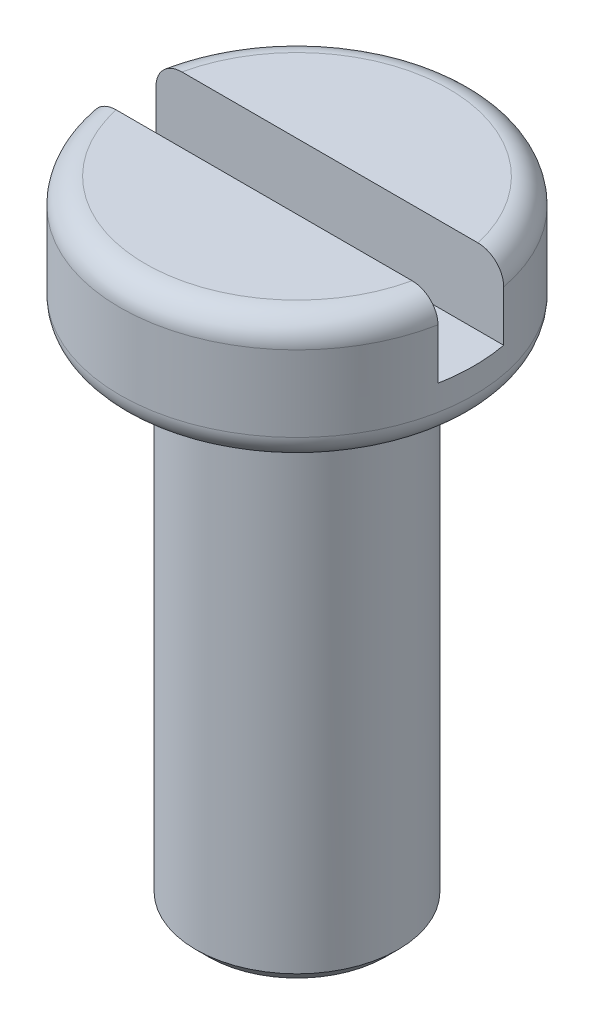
ISO-10303-21;
HEADER;
FILE_DESCRIPTION(('STEP AP214'),'2;1');
FILE_NAME('part.step','',(''),(''),'','','');
FILE_SCHEMA(('AUTOMOTIVE_DESIGN { 1 0 10303 214 1 1 1 1 }'));
ENDSEC;
DATA;
#1=APPLICATION_CONTEXT('core data for automotive mechanical design processes');
#2=APPLICATION_PROTOCOL_DEFINITION('international standard','automotive_design',2000,#1);
#3=PRODUCT_CONTEXT('',#1,'mechanical');
#4=PRODUCT('Part','Part','',(#3));
#5=PRODUCT_RELATED_PRODUCT_CATEGORY('part','',(#4));
#6=PRODUCT_DEFINITION_FORMATION('','',#4);
#7=PRODUCT_DEFINITION_CONTEXT('part definition',#1,'design');
#8=PRODUCT_DEFINITION('design','',#6,#7);
#9=PRODUCT_DEFINITION_SHAPE('','',#8);
#10=(LENGTH_UNIT() NAMED_UNIT(*) SI_UNIT(.MILLI.,.METRE.));
#11=(NAMED_UNIT(*) PLANE_ANGLE_UNIT() SI_UNIT($,.RADIAN.));
#12=(NAMED_UNIT(*) SI_UNIT($,.STERADIAN.) SOLID_ANGLE_UNIT());
#13=UNCERTAINTY_MEASURE_WITH_UNIT(LENGTH_MEASURE(1.E-05),#10,'distance_accuracy_value','');
#14=(GEOMETRIC_REPRESENTATION_CONTEXT(3) GLOBAL_UNCERTAINTY_ASSIGNED_CONTEXT((#13)) GLOBAL_UNIT_ASSIGNED_CONTEXT((#10,
#11,#12)) REPRESENTATION_CONTEXT('',''));
#15=CARTESIAN_POINT('',(0.,0.,0.));
#16=DIRECTION('',(0.,0.,1.));
#17=DIRECTION('',(1.,0.,0.));
#18=AXIS2_PLACEMENT_3D('',#15,#16,#17);
#19=CARTESIAN_POINT('',(0.,2.5,0.));
#20=DIRECTION('',(0.,1.,0.));
#21=DIRECTION('',(0.,0.,1.));
#22=AXIS2_PLACEMENT_3D('',#19,#20,#21);
#23=PLANE('',#22);
#24=DIRECTION('',(-1.,0.,0.));
#25=VECTOR('',#24,1.);
#26=CARTESIAN_POINT('',(-3.43911325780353,2.5,-0.65));
#27=LINE('',#26,#25);
#28=CARTESIAN_POINT('',(2.92873692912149,2.5,-0.65));
#29=VERTEX_POINT('',#28);
#30=CARTESIAN_POINT('',(-2.92873692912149,2.5,-0.65));
#31=VERTEX_POINT('',#30);
#32=EDGE_CURVE('E111',#29,#31,#27,.T.);
#33=ORIENTED_EDGE('',*,*,#32,.F.);
#34=CARTESIAN_POINT('',(0.,2.5,0.));
#35=DIRECTION('',(0.,1.,0.));
#36=DIRECTION('',(0.,0.,1.));
#37=AXIS2_PLACEMENT_3D('',#34,#35,#36);
#38=CIRCLE('',#37,3.);
#39=EDGE_CURVE('E183',#29,#31,#38,.T.);
#40=ORIENTED_EDGE('',*,*,#39,.T.);
#41=EDGE_LOOP('',(#33,#40));
#42=FACE_BOUND('',#41,.T.);
#43=ADVANCED_FACE('F34',(#42),#23,.T.);
#44=CARTESIAN_POINT('',(0.,2.5,0.));
#45=DIRECTION('',(0.,-1.,0.));
#46=DIRECTION('',(0.,0.,-1.));
#47=AXIS2_PLACEMENT_3D('',#44,#45,#46);
#48=CYLINDRICAL_SURFACE('',#47,3.5);
#49=CARTESIAN_POINT('',(0.,0.5,0.));
#50=DIRECTION('',(0.,1.,0.));
#51=DIRECTION('',(0.,0.,1.));
#52=AXIS2_PLACEMENT_3D('',#49,#50,#51);
#53=CIRCLE('',#52,3.5);
#54=CARTESIAN_POINT('',(0.,0.5,3.5));
#55=VERTEX_POINT('',#54);
#56=EDGE_CURVE('E126',#55,#55,#53,.T.);
#57=ORIENTED_EDGE('',*,*,#56,.T.);
#58=EDGE_LOOP('',(#57));
#59=FACE_BOUND('',#58,.T.);
#60=DIRECTION('',(0.,1.,0.));
#61=VECTOR('',#60,1.);
#62=CARTESIAN_POINT('',(3.43911325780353,1.,0.65));
#63=LINE('',#62,#61);
#64=CARTESIAN_POINT('',(3.43911325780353,1.,0.65));
#65=VERTEX_POINT('',#64);
#66=CARTESIAN_POINT('',(3.43911325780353,2.,0.65));
#67=VERTEX_POINT('',#66);
#68=EDGE_CURVE('E98',#65,#67,#63,.T.);
#69=ORIENTED_EDGE('',*,*,#68,.T.);
#70=CARTESIAN_POINT('',(0.,2.,0.));
#71=DIRECTION('',(0.,1.,0.));
#72=DIRECTION('',(0.,0.,1.));
#73=AXIS2_PLACEMENT_3D('',#70,#71,#72);
#74=CIRCLE('',#73,3.5);
#75=CARTESIAN_POINT('',(-3.43911325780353,2.,0.65));
#76=VERTEX_POINT('',#75);
#77=EDGE_CURVE('E115',#67,#76,#74,.F.);
#78=ORIENTED_EDGE('',*,*,#77,.T.);
#79=DIRECTION('',(0.,1.,0.));
#80=VECTOR('',#79,1.);
#81=CARTESIAN_POINT('',(-3.43911325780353,1.,0.65));
#82=LINE('',#81,#80);
#83=CARTESIAN_POINT('',(-3.43911325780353,1.,0.65));
#84=VERTEX_POINT('',#83);
#85=EDGE_CURVE('E95',#84,#76,#82,.T.);
#86=ORIENTED_EDGE('',*,*,#85,.F.);
#87=CARTESIAN_POINT('',(0.,1.,0.));
#88=DIRECTION('',(0.,1.,0.));
#89=DIRECTION('',(0.,0.,1.));
#90=AXIS2_PLACEMENT_3D('',#87,#88,#89);
#91=CIRCLE('',#90,3.5);
#92=CARTESIAN_POINT('',(-3.43911325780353,1.,-0.65));
#93=VERTEX_POINT('',#92);
#94=EDGE_CURVE('E102',#93,#84,#91,.T.);
#95=ORIENTED_EDGE('',*,*,#94,.F.);
#96=DIRECTION('',(0.,1.,0.));
#97=VECTOR('',#96,1.);
#98=CARTESIAN_POINT('',(-3.43911325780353,1.,-0.65));
#99=LINE('',#98,#97);
#100=CARTESIAN_POINT('',(-3.43911325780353,2.,-0.65));
#101=VERTEX_POINT('',#100);
#102=EDGE_CURVE('E124',#93,#101,#99,.T.);
#103=ORIENTED_EDGE('',*,*,#102,.T.);
#104=CARTESIAN_POINT('',(0.,2.,0.));
#105=DIRECTION('',(0.,1.,0.));
#106=DIRECTION('',(0.,0.,1.));
#107=AXIS2_PLACEMENT_3D('',#104,#105,#106);
#108=CIRCLE('',#107,3.5);
#109=CARTESIAN_POINT('',(3.43911325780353,2.,-0.65));
#110=VERTEX_POINT('',#109);
#111=EDGE_CURVE('E122',#101,#110,#108,.F.);
#112=ORIENTED_EDGE('',*,*,#111,.T.);
#113=DIRECTION('',(0.,1.,0.));
#114=VECTOR('',#113,1.);
#115=CARTESIAN_POINT('',(3.43911325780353,1.,-0.65));
#116=LINE('',#115,#114);
#117=CARTESIAN_POINT('',(3.43911325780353,1.,-0.65));
#118=VERTEX_POINT('',#117);
#119=EDGE_CURVE('E117',#118,#110,#116,.T.);
#120=ORIENTED_EDGE('',*,*,#119,.F.);
#121=CARTESIAN_POINT('',(0.,1.,0.));
#122=DIRECTION('',(0.,1.,0.));
#123=DIRECTION('',(0.,0.,-1.));
#124=AXIS2_PLACEMENT_3D('',#121,#122,#123);
#125=CIRCLE('',#124,3.50000000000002);
#126=EDGE_CURVE('E101',#65,#118,#125,.T.);
#127=ORIENTED_EDGE('',*,*,#126,.F.);
#128=EDGE_LOOP('',(#69,#78,#86,#95,#103,#112,#120,#127));
#129=FACE_BOUND('',#128,.T.);
#130=ADVANCED_FACE('F113',(#59,#129),#48,.T.);
#131=DIRECTION('',(1.,0.,0.));
#132=VECTOR('',#131,1.);
#133=CARTESIAN_POINT('',(-3.43911325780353,2.5,0.65));
#134=LINE('',#133,#132);
#135=CARTESIAN_POINT('',(-2.92873692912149,2.5,0.65));
#136=VERTEX_POINT('',#135);
#137=CARTESIAN_POINT('',(2.92873692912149,2.5,0.65));
#138=VERTEX_POINT('',#137);
#139=EDGE_CURVE('E184',#136,#138,#134,.T.);
#140=ORIENTED_EDGE('',*,*,#139,.F.);
#141=CARTESIAN_POINT('',(0.,2.5,0.));
#142=DIRECTION('',(0.,1.,0.));
#143=DIRECTION('',(0.,0.,1.));
#144=AXIS2_PLACEMENT_3D('',#141,#142,#143);
#145=CIRCLE('',#144,3.);
#146=EDGE_CURVE('E132',#136,#138,#145,.T.);
#147=ORIENTED_EDGE('',*,*,#146,.T.);
#148=EDGE_LOOP('',(#140,#147));
#149=FACE_BOUND('',#148,.T.);
#150=ADVANCED_FACE('F157',(#149),#23,.T.);
#151=CARTESIAN_POINT('',(0.,0.,0.));
#152=DIRECTION('',(0.,1.,0.));
#153=DIRECTION('',(0.,0.,1.));
#154=AXIS2_PLACEMENT_3D('',#151,#152,#153);
#155=PLANE('',#154);
#156=CARTESIAN_POINT('',(0.,0.,0.));
#157=DIRECTION('',(0.,1.,0.));
#158=DIRECTION('',(0.,0.,1.));
#159=AXIS2_PLACEMENT_3D('',#156,#157,#158);
#160=CIRCLE('',#159,2.);
#161=CARTESIAN_POINT('',(0.,0.,2.));
#162=VERTEX_POINT('',#161);
#163=EDGE_CURVE('E214',#162,#162,#160,.F.);
#164=ORIENTED_EDGE('',*,*,#163,.F.);
#165=EDGE_LOOP('',(#164));
#166=FACE_BOUND('',#165,.T.);
#167=CARTESIAN_POINT('',(0.,0.,0.));
#168=DIRECTION('',(0.,1.,0.));
#169=DIRECTION('',(0.,0.,1.));
#170=AXIS2_PLACEMENT_3D('',#167,#168,#169);
#171=CIRCLE('',#170,3.);
#172=CARTESIAN_POINT('',(0.,0.,3.));
#173=VERTEX_POINT('',#172);
#174=EDGE_CURVE('E129',#173,#173,#171,.F.);
#175=ORIENTED_EDGE('',*,*,#174,.T.);
#176=EDGE_LOOP('',(#175));
#177=FACE_BOUND('',#176,.T.);
#178=ADVANCED_FACE('F161',(#166,#177),#155,.F.);
#179=CARTESIAN_POINT('',(-3.43911325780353,1.,-0.65));
#180=DIRECTION('',(0.,0.,-1.));
#181=DIRECTION('',(-1.,0.,0.));
#182=AXIS2_PLACEMENT_3D('',#179,#180,#181);
#183=PLANE('',#182);
#184=ORIENTED_EDGE('',*,*,#32,.T.);
#185=CARTESIAN_POINT('',(-2.92873692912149,2.5,-0.65));
#186=CARTESIAN_POINT('',(-2.95792873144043,2.50002267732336,-0.65));
#187=CARTESIAN_POINT('',(-2.98712021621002,2.49756469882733,-0.65));
#188=CARTESIAN_POINT('',(-3.04468761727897,2.48782611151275,-0.65));
#189=CARTESIAN_POINT('',(-3.07306352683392,2.48054546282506,-0.65));
#190=CARTESIAN_POINT('',(-3.12820803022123,2.46129194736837,-0.65));
#191=CARTESIAN_POINT('',(-3.15497522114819,2.44931505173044,-0.65));
#192=CARTESIAN_POINT('',(-3.20607025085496,2.42098243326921,-0.65));
#193=CARTESIAN_POINT('',(-3.23039914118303,2.40462860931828,-0.65));
#194=CARTESIAN_POINT('',(-3.27557433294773,2.36822625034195,-0.65));
#195=CARTESIAN_POINT('',(-3.29646325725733,2.3482306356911,-0.65));
#196=CARTESIAN_POINT('',(-3.33451025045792,2.30494750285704,-0.65));
#197=CARTESIAN_POINT('',(-3.35166769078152,2.2816594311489,-0.65));
#198=CARTESIAN_POINT('',(-3.38140501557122,2.2329509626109,-0.65));
#199=CARTESIAN_POINT('',(-3.39406763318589,2.20758099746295,-0.65));
#200=CARTESIAN_POINT('',(-3.41487030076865,2.15506050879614,-0.65));
#201=CARTESIAN_POINT('',(-3.42301421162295,2.12791152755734,-0.65));
#202=CARTESIAN_POINT('',(-3.43221018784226,2.08379221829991,-0.65));
#203=CARTESIAN_POINT('',(-3.43479752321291,2.06712693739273,-0.65));
#204=CARTESIAN_POINT('',(-3.43824848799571,2.03364370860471,-0.65));
#205=CARTESIAN_POINT('',(-3.43911464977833,2.01682602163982,-0.65));
#206=CARTESIAN_POINT('',(-3.43911325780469,2.00000000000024,-0.65));
#207=B_SPLINE_CURVE_WITH_KNOTS('',3,(#185,#186,#187,#188,#189,#190,#191,#192,#193,#194,#195,
#196,#197,#198,#199,#200,#201,#202,#203,#204,#205,#206),.UNSPECIFIED.,.F.,.F.,(4,2,2,2,2,2,2,2,
2,2,4),(0.,0.0874723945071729,0.174945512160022,0.262493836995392,0.350004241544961,
0.436331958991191,0.522674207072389,0.607332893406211,0.691919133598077,0.742432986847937,
0.792872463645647),.UNSPECIFIED.);
#208=EDGE_CURVE('E49',#31,#101,#207,.T.);
#209=ORIENTED_EDGE('',*,*,#208,.T.);
#210=ORIENTED_EDGE('',*,*,#102,.F.);
#211=DIRECTION('',(-1.,0.,0.));
#212=VECTOR('',#211,1.);
#213=CARTESIAN_POINT('',(-3.43911325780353,1.,-0.65));
#214=LINE('',#213,#212);
#215=EDGE_CURVE('E108',#118,#93,#214,.T.);
#216=ORIENTED_EDGE('',*,*,#215,.F.);
#217=ORIENTED_EDGE('',*,*,#119,.T.);
#218=CARTESIAN_POINT('',(3.43911325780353,2.,-0.65));
#219=CARTESIAN_POINT('',(3.43913889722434,2.02775947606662,-0.65));
#220=CARTESIAN_POINT('',(3.43676218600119,2.05550931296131,-0.65));
#221=CARTESIAN_POINT('',(3.42739618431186,2.11018556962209,-0.65));
#222=CARTESIAN_POINT('',(3.42041258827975,2.1371129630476,-0.65));
#223=CARTESIAN_POINT('',(3.40202102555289,2.18942116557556,-0.65));
#224=CARTESIAN_POINT('',(3.39061159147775,2.21480145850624,-0.65));
#225=CARTESIAN_POINT('',(3.36372457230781,2.26330231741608,-0.65));
#226=CARTESIAN_POINT('',(3.34824720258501,2.28642300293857,-0.65));
#227=CARTESIAN_POINT('',(3.3135629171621,2.32993329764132,-0.65));
#228=CARTESIAN_POINT('',(3.29433111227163,2.350303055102,-0.65));
#229=CARTESIAN_POINT('',(3.25276768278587,2.38759157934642,-0.65));
#230=CARTESIAN_POINT('',(3.23043544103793,2.40450965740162,-0.65));
#231=CARTESIAN_POINT('',(3.18291250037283,2.43471951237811,-0.65));
#232=CARTESIAN_POINT('',(3.15768005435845,2.44794553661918,-0.65));
#233=CARTESIAN_POINT('',(3.10538462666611,2.47006329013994,-0.65));
#234=CARTESIAN_POINT('',(3.07832208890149,2.47895606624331,-0.65));
#235=CARTESIAN_POINT('',(3.03075677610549,2.4903779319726,-0.65));
#236=CARTESIAN_POINT('',(3.01050564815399,2.49398609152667,-0.65));
#237=CARTESIAN_POINT('',(2.96975060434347,2.49879703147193,-0.65));
#238=CARTESIAN_POINT('',(2.94924711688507,2.50000343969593,-0.65));
#239=CARTESIAN_POINT('',(2.92873692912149,2.5,-0.65));
#240=B_SPLINE_CURVE_WITH_KNOTS('',3,(#218,#219,#220,#221,#222,#223,#224,#225,#226,#227,#228,
#229,#230,#231,#232,#233,#234,#235,#236,#237,#238,#239),.UNSPECIFIED.,.F.,.F.,(4,2,2,2,2,2,2,2,
2,2,4),(0.,0.0831625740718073,0.166222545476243,0.249310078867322,0.332393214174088,
0.416047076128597,0.499717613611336,0.584794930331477,0.669851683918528,0.731426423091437,
0.792908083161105),.UNSPECIFIED.);
#241=EDGE_CURVE('E57',#110,#29,#240,.T.);
#242=ORIENTED_EDGE('',*,*,#241,.T.);
#243=EDGE_LOOP('',(#184,#209,#210,#216,#217,#242));
#244=FACE_BOUND('',#243,.T.);
#245=ADVANCED_FACE('F154',(#244),#183,.F.);
#246=CARTESIAN_POINT('',(-3.43911325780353,1.,0.65));
#247=DIRECTION('',(0.,0.,1.));
#248=DIRECTION('',(1.,0.,0.));
#249=AXIS2_PLACEMENT_3D('',#246,#247,#248);
#250=PLANE('',#249);
#251=ORIENTED_EDGE('',*,*,#139,.T.);
#252=CARTESIAN_POINT('',(2.92873692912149,2.5,0.65));
#253=CARTESIAN_POINT('',(2.95792873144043,2.50002267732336,0.65));
#254=CARTESIAN_POINT('',(2.98712021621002,2.49756469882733,0.65));
#255=CARTESIAN_POINT('',(3.04468761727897,2.48782611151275,0.65));
#256=CARTESIAN_POINT('',(3.07306352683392,2.48054546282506,0.65));
#257=CARTESIAN_POINT('',(3.12820803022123,2.46129194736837,0.65));
#258=CARTESIAN_POINT('',(3.15497522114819,2.44931505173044,0.65));
#259=CARTESIAN_POINT('',(3.20607025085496,2.42098243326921,0.65));
#260=CARTESIAN_POINT('',(3.23039914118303,2.40462860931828,0.65));
#261=CARTESIAN_POINT('',(3.27557433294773,2.36822625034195,0.65));
#262=CARTESIAN_POINT('',(3.29646325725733,2.3482306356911,0.65));
#263=CARTESIAN_POINT('',(3.33451025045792,2.30494750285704,0.65));
#264=CARTESIAN_POINT('',(3.35166769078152,2.2816594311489,0.65));
#265=CARTESIAN_POINT('',(3.38140501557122,2.2329509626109,0.65));
#266=CARTESIAN_POINT('',(3.39406763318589,2.20758099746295,0.65));
#267=CARTESIAN_POINT('',(3.41487030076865,2.15506050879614,0.65));
#268=CARTESIAN_POINT('',(3.42301421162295,2.12791152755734,0.65));
#269=CARTESIAN_POINT('',(3.43221018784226,2.08379221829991,0.65));
#270=CARTESIAN_POINT('',(3.43479752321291,2.06712693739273,0.65));
#271=CARTESIAN_POINT('',(3.43824848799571,2.03364370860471,0.65));
#272=CARTESIAN_POINT('',(3.43911464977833,2.01682602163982,0.65));
#273=CARTESIAN_POINT('',(3.43911325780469,2.00000000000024,0.65));
#274=B_SPLINE_CURVE_WITH_KNOTS('',3,(#252,#253,#254,#255,#256,#257,#258,#259,#260,#261,#262,
#263,#264,#265,#266,#267,#268,#269,#270,#271,#272,#273),.UNSPECIFIED.,.F.,.F.,(4,2,2,2,2,2,2,2,
2,2,4),(0.,0.0874723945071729,0.174945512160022,0.262493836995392,0.350004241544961,
0.436331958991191,0.522674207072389,0.607332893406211,0.691919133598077,0.742432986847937,
0.792872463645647),.UNSPECIFIED.);
#275=EDGE_CURVE('E142',#138,#67,#274,.T.);
#276=ORIENTED_EDGE('',*,*,#275,.T.);
#277=ORIENTED_EDGE('',*,*,#68,.F.);
#278=DIRECTION('',(1.,0.,0.));
#279=VECTOR('',#278,1.);
#280=CARTESIAN_POINT('',(-3.43911325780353,1.,0.65));
#281=LINE('',#280,#279);
#282=EDGE_CURVE('E90',#84,#65,#281,.T.);
#283=ORIENTED_EDGE('',*,*,#282,.F.);
#284=ORIENTED_EDGE('',*,*,#85,.T.);
#285=CARTESIAN_POINT('',(-3.43911325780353,2.,0.65));
#286=CARTESIAN_POINT('',(-3.43913889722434,2.02775947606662,0.65));
#287=CARTESIAN_POINT('',(-3.43676218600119,2.05550931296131,0.65));
#288=CARTESIAN_POINT('',(-3.42739618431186,2.11018556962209,0.65));
#289=CARTESIAN_POINT('',(-3.42041258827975,2.1371129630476,0.65));
#290=CARTESIAN_POINT('',(-3.40202102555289,2.18942116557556,0.65));
#291=CARTESIAN_POINT('',(-3.39061159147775,2.21480145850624,0.65));
#292=CARTESIAN_POINT('',(-3.36372457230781,2.26330231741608,0.65));
#293=CARTESIAN_POINT('',(-3.34824720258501,2.28642300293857,0.65));
#294=CARTESIAN_POINT('',(-3.3135629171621,2.32993329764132,0.65));
#295=CARTESIAN_POINT('',(-3.29433111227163,2.350303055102,0.65));
#296=CARTESIAN_POINT('',(-3.25276768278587,2.38759157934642,0.65));
#297=CARTESIAN_POINT('',(-3.23043544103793,2.40450965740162,0.65));
#298=CARTESIAN_POINT('',(-3.18291250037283,2.43471951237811,0.65));
#299=CARTESIAN_POINT('',(-3.15768005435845,2.44794553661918,0.65));
#300=CARTESIAN_POINT('',(-3.10538462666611,2.47006329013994,0.65));
#301=CARTESIAN_POINT('',(-3.07832208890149,2.47895606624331,0.65));
#302=CARTESIAN_POINT('',(-3.03075677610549,2.4903779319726,0.65));
#303=CARTESIAN_POINT('',(-3.01050564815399,2.49398609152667,0.65));
#304=CARTESIAN_POINT('',(-2.96975060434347,2.49879703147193,0.65));
#305=CARTESIAN_POINT('',(-2.94924711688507,2.50000343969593,0.65));
#306=CARTESIAN_POINT('',(-2.92873692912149,2.5,0.65));
#307=B_SPLINE_CURVE_WITH_KNOTS('',3,(#285,#286,#287,#288,#289,#290,#291,#292,#293,#294,#295,
#296,#297,#298,#299,#300,#301,#302,#303,#304,#305,#306),.UNSPECIFIED.,.F.,.F.,(4,2,2,2,2,2,2,2,
2,2,4),(0.,0.0831625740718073,0.166222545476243,0.249310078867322,0.332393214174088,
0.416047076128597,0.499717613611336,0.584794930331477,0.669851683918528,0.731426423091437,
0.792908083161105),.UNSPECIFIED.);
#308=EDGE_CURVE('E135',#76,#136,#307,.T.);
#309=ORIENTED_EDGE('',*,*,#308,.T.);
#310=EDGE_LOOP('',(#251,#276,#277,#283,#284,#309));
#311=FACE_BOUND('',#310,.T.);
#312=ADVANCED_FACE('F93',(#311),#250,.F.);
#313=CARTESIAN_POINT('',(0.,1.,0.));
#314=DIRECTION('',(0.,1.,0.));
#315=DIRECTION('',(0.,0.,1.));
#316=AXIS2_PLACEMENT_3D('',#313,#314,#315);
#317=PLANE('',#316);
#318=ORIENTED_EDGE('',*,*,#94,.T.);
#319=ORIENTED_EDGE('',*,*,#282,.T.);
#320=ORIENTED_EDGE('',*,*,#126,.T.);
#321=ORIENTED_EDGE('',*,*,#215,.T.);
#322=EDGE_LOOP('',(#318,#319,#320,#321));
#323=FACE_BOUND('',#322,.T.);
#324=ADVANCED_FACE('F106',(#323),#317,.T.);
#325=CARTESIAN_POINT('',(0.,0.5,0.));
#326=DIRECTION('',(0.,1.,0.));
#327=DIRECTION('',(0.,0.,1.));
#328=AXIS2_PLACEMENT_3D('',#325,#326,#327);
#329=TOROIDAL_SURFACE('',#328,3.,0.5);
#330=ORIENTED_EDGE('',*,*,#174,.F.);
#331=EDGE_LOOP('',(#330));
#332=FACE_BOUND('',#331,.T.);
#333=ORIENTED_EDGE('',*,*,#56,.F.);
#334=EDGE_LOOP('',(#333));
#335=FACE_BOUND('',#334,.T.);
#336=ADVANCED_FACE('F168',(#332,#335),#329,.T.);
#337=CARTESIAN_POINT('',(0.,2.,0.));
#338=DIRECTION('',(0.,1.,0.));
#339=DIRECTION('',(0.,0.,1.));
#340=AXIS2_PLACEMENT_3D('',#337,#338,#339);
#341=TOROIDAL_SURFACE('',#340,3.,0.5);
#342=ORIENTED_EDGE('',*,*,#308,.F.);
#343=ORIENTED_EDGE('',*,*,#77,.F.);
#344=ORIENTED_EDGE('',*,*,#275,.F.);
#345=ORIENTED_EDGE('',*,*,#146,.F.);
#346=EDGE_LOOP('',(#342,#343,#344,#345));
#347=FACE_BOUND('',#346,.T.);
#348=ADVANCED_FACE('F147',(#347),#341,.T.);
#349=CARTESIAN_POINT('',(0.,2.,0.));
#350=DIRECTION('',(0.,1.,0.));
#351=DIRECTION('',(0.,0.,1.));
#352=AXIS2_PLACEMENT_3D('',#349,#350,#351);
#353=TOROIDAL_SURFACE('',#352,3.,0.5);
#354=ORIENTED_EDGE('',*,*,#241,.F.);
#355=ORIENTED_EDGE('',*,*,#111,.F.);
#356=ORIENTED_EDGE('',*,*,#208,.F.);
#357=ORIENTED_EDGE('',*,*,#39,.F.);
#358=EDGE_LOOP('',(#354,#355,#356,#357));
#359=FACE_BOUND('',#358,.T.);
#360=ADVANCED_FACE('F175',(#359),#353,.T.);
#361=CARTESIAN_POINT('',(0.,-10.,0.));
#362=DIRECTION('',(0.,1.,0.));
#363=DIRECTION('',(0.,0.,1.));
#364=AXIS2_PLACEMENT_3D('',#361,#362,#363);
#365=CYLINDRICAL_SURFACE('',#364,2.);
#366=CARTESIAN_POINT('',(0.,-9.75,0.));
#367=DIRECTION('',(0.,-1.,0.));
#368=DIRECTION('',(0.,0.,-1.));
#369=AXIS2_PLACEMENT_3D('',#366,#367,#368);
#370=CIRCLE('',#369,2.);
#371=CARTESIAN_POINT('',(0.,-9.75,-2.));
#372=VERTEX_POINT('',#371);
#373=EDGE_CURVE('E11',#372,#372,#370,.F.);
#374=ORIENTED_EDGE('',*,*,#373,.T.);
#375=EDGE_LOOP('',(#374));
#376=FACE_BOUND('',#375,.T.);
#377=ORIENTED_EDGE('',*,*,#163,.T.);
#378=EDGE_LOOP('',(#377));
#379=FACE_BOUND('',#378,.T.);
#380=ADVANCED_FACE('F197',(#376,#379),#365,.T.);
#381=CARTESIAN_POINT('',(0.,-10.,0.));
#382=DIRECTION('',(0.,-1.,0.));
#383=DIRECTION('',(0.,0.,-1.));
#384=AXIS2_PLACEMENT_3D('',#381,#382,#383);
#385=PLANE('',#384);
#386=CARTESIAN_POINT('',(0.,-10.,0.));
#387=DIRECTION('',(0.,-1.,0.));
#388=DIRECTION('',(0.,0.,-1.));
#389=AXIS2_PLACEMENT_3D('',#386,#387,#388);
#390=CIRCLE('',#389,1.75);
#391=CARTESIAN_POINT('',(0.,-10.,-1.75));
#392=VERTEX_POINT('',#391);
#393=EDGE_CURVE('E42',#392,#392,#390,.T.);
#394=ORIENTED_EDGE('',*,*,#393,.T.);
#395=EDGE_LOOP('',(#394));
#396=FACE_BOUND('',#395,.T.);
#397=ADVANCED_FACE('F202',(#396),#385,.T.);
#398=CARTESIAN_POINT('',(0.,-10.,0.));
#399=DIRECTION('',(0.,1.,0.));
#400=DIRECTION('',(0.,0.,1.));
#401=AXIS2_PLACEMENT_3D('',#398,#399,#400);
#402=CONICAL_SURFACE('',#401,1.75,0.785398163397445);
#403=ORIENTED_EDGE('',*,*,#373,.F.);
#404=EDGE_LOOP('',(#403));
#405=FACE_BOUND('',#404,.T.);
#406=ORIENTED_EDGE('',*,*,#393,.F.);
#407=EDGE_LOOP('',(#406));
#408=FACE_BOUND('',#407,.T.);
#409=ADVANCED_FACE('F36',(#405,#408),#402,.T.);
#410=CLOSED_SHELL('',(#43,#130,#150,#178,#245,#312,#324,#336,#348,#360,#380,#397,#409));
#411=MANIFOLD_SOLID_BREP('B2',#410);
#412=ADVANCED_BREP_SHAPE_REPRESENTATION('',(#18,#411),#14);
#413=SHAPE_DEFINITION_REPRESENTATION(#9,#412);
ENDSEC;
END-ISO-10303-21;
